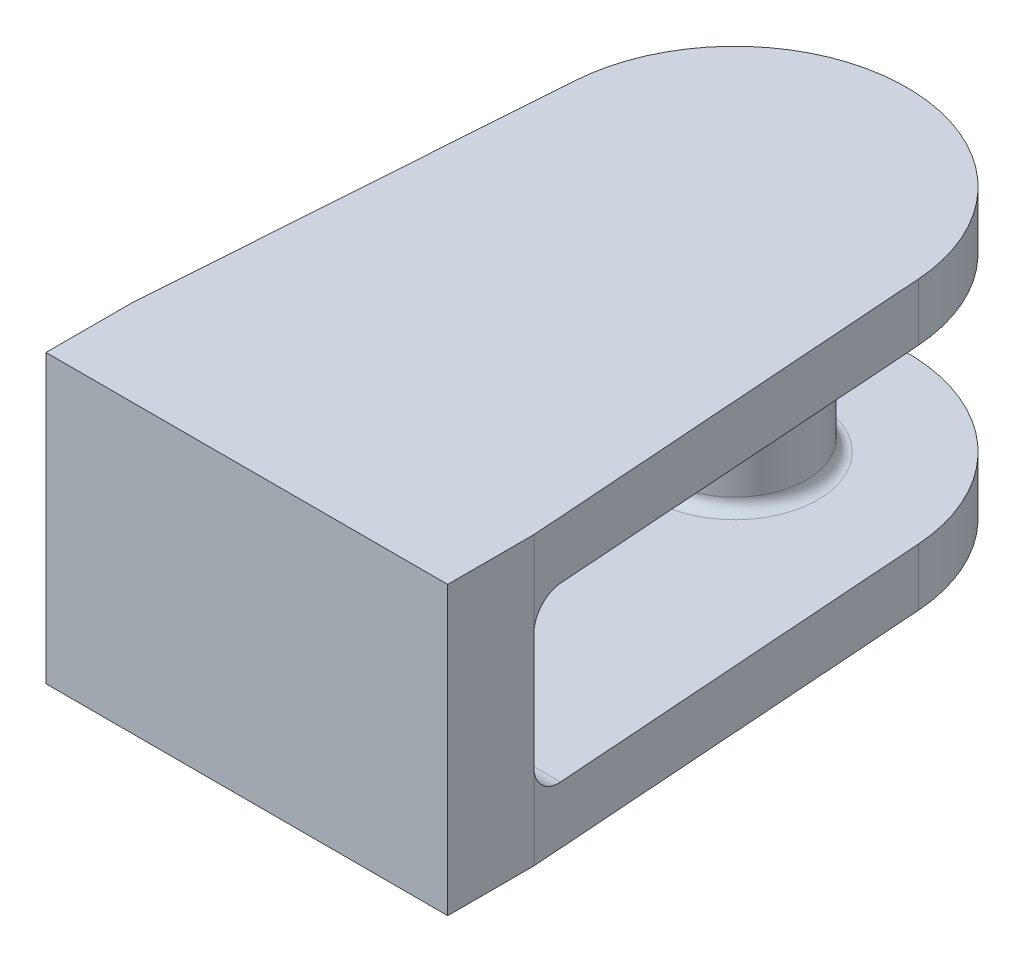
ISO-10303-21;
HEADER;
FILE_DESCRIPTION(('STEP AP214'),'2;1');
FILE_NAME('part.step','',(''),(''),'','','');
FILE_SCHEMA(('AUTOMOTIVE_DESIGN { 1 0 10303 214 1 1 1 1 }'));
ENDSEC;
DATA;
#1=APPLICATION_CONTEXT('core data for automotive mechanical design processes');
#2=APPLICATION_PROTOCOL_DEFINITION('international standard','automotive_design',2000,#1);
#3=PRODUCT_CONTEXT('',#1,'mechanical');
#4=PRODUCT('Part','Part','',(#3));
#5=PRODUCT_RELATED_PRODUCT_CATEGORY('part','',(#4));
#6=PRODUCT_DEFINITION_FORMATION('','',#4);
#7=PRODUCT_DEFINITION_CONTEXT('part definition',#1,'design');
#8=PRODUCT_DEFINITION('design','',#6,#7);
#9=PRODUCT_DEFINITION_SHAPE('','',#8);
#10=(LENGTH_UNIT() NAMED_UNIT(*) SI_UNIT(.MILLI.,.METRE.));
#11=(NAMED_UNIT(*) PLANE_ANGLE_UNIT() SI_UNIT($,.RADIAN.));
#12=(NAMED_UNIT(*) SI_UNIT($,.STERADIAN.) SOLID_ANGLE_UNIT());
#13=UNCERTAINTY_MEASURE_WITH_UNIT(LENGTH_MEASURE(1.E-05),#10,'distance_accuracy_value','');
#14=(GEOMETRIC_REPRESENTATION_CONTEXT(3) GLOBAL_UNCERTAINTY_ASSIGNED_CONTEXT((#13)) GLOBAL_UNIT_ASSIGNED_CONTEXT((#10,
#11,#12)) REPRESENTATION_CONTEXT('',''));
#15=CARTESIAN_POINT('',(0.,0.,0.));
#16=DIRECTION('',(0.,0.,1.));
#17=DIRECTION('',(1.,0.,0.));
#18=AXIS2_PLACEMENT_3D('',#15,#16,#17);
#19=CARTESIAN_POINT('',(0.,38.1,0.));
#20=DIRECTION('',(0.,-1.,0.));
#21=DIRECTION('',(0.,0.,-1.));
#22=AXIS2_PLACEMENT_3D('',#19,#20,#21);
#23=CYLINDRICAL_SURFACE('',#22,15.875);
#24=CARTESIAN_POINT('',(0.,2.54,0.));
#25=DIRECTION('',(0.,-1.,0.));
#26=DIRECTION('',(0.,0.,-1.));
#27=AXIS2_PLACEMENT_3D('',#24,#25,#26);
#28=CIRCLE('',#27,15.875);
#29=CARTESIAN_POINT('',(0.,2.54,-15.875));
#30=VERTEX_POINT('',#29);
#31=EDGE_CURVE('E41',#30,#30,#28,.F.);
#32=CARTESIAN_POINT('',(0.,35.56,0.));
#33=DIRECTION('',(0.,-1.,0.));
#34=DIRECTION('',(0.,0.,-1.));
#35=AXIS2_PLACEMENT_3D('',#32,#33,#34);
#36=CIRCLE('',#35,15.875);
#37=CARTESIAN_POINT('',(0.,35.56,-15.875));
#38=VERTEX_POINT('',#37);
#39=EDGE_CURVE('E144',#38,#38,#36,.T.);
#40=CARTESIAN_POINT('',(0.,2.54,-15.875));
#41=CARTESIAN_POINT('',(0.,2.88395833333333,-15.875));
#42=CARTESIAN_POINT('',(0.,3.22791666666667,-15.875));
#43=CARTESIAN_POINT('',(0.,3.91583333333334,-15.875));
#44=CARTESIAN_POINT('',(0.,4.25979166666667,-15.875));
#45=CARTESIAN_POINT('',(0.,4.94770833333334,-15.875));
#46=CARTESIAN_POINT('',(0.,5.29166666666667,-15.875));
#47=CARTESIAN_POINT('',(0.,5.97958333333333,-15.875));
#48=CARTESIAN_POINT('',(0.,6.32354166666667,-15.875));
#49=CARTESIAN_POINT('',(0.,7.01145833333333,-15.875));
#50=CARTESIAN_POINT('',(0.,7.35541666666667,-15.875));
#51=CARTESIAN_POINT('',(0.,8.04333333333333,-15.875));
#52=CARTESIAN_POINT('',(0.,8.38729166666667,-15.875));
#53=CARTESIAN_POINT('',(0.,9.07520833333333,-15.875));
#54=CARTESIAN_POINT('',(0.,9.41916666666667,-15.875));
#55=CARTESIAN_POINT('',(0.,10.1070833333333,-15.875));
#56=CARTESIAN_POINT('',(0.,10.4510416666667,-15.875));
#57=CARTESIAN_POINT('',(0.,11.1389583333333,-15.875));
#58=CARTESIAN_POINT('',(0.,11.4829166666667,-15.875));
#59=CARTESIAN_POINT('',(0.,12.1708333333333,-15.875));
#60=CARTESIAN_POINT('',(0.,12.5147916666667,-15.875));
#61=CARTESIAN_POINT('',(0.,13.2027083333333,-15.875));
#62=CARTESIAN_POINT('',(0.,13.5466666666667,-15.875));
#63=CARTESIAN_POINT('',(0.,14.2345833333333,-15.875));
#64=CARTESIAN_POINT('',(0.,14.5785416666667,-15.875));
#65=CARTESIAN_POINT('',(0.,15.2664583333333,-15.875));
#66=CARTESIAN_POINT('',(0.,15.6104166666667,-15.875));
#67=CARTESIAN_POINT('',(0.,16.2983333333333,-15.875));
#68=CARTESIAN_POINT('',(0.,16.6422916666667,-15.875));
#69=CARTESIAN_POINT('',(0.,17.3302083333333,-15.875));
#70=CARTESIAN_POINT('',(0.,17.6741666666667,-15.875));
#71=CARTESIAN_POINT('',(0.,18.3620833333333,-15.875));
#72=CARTESIAN_POINT('',(0.,18.7060416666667,-15.875));
#73=CARTESIAN_POINT('',(0.,19.3939583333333,-15.875));
#74=CARTESIAN_POINT('',(0.,19.7379166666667,-15.875));
#75=CARTESIAN_POINT('',(0.,20.4258333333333,-15.875));
#76=CARTESIAN_POINT('',(0.,20.7697916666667,-15.875));
#77=CARTESIAN_POINT('',(0.,21.4577083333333,-15.875));
#78=CARTESIAN_POINT('',(0.,21.8016666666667,-15.875));
#79=CARTESIAN_POINT('',(0.,22.4895833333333,-15.875));
#80=CARTESIAN_POINT('',(0.,22.8335416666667,-15.875));
#81=CARTESIAN_POINT('',(0.,23.5214583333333,-15.875));
#82=CARTESIAN_POINT('',(0.,23.8654166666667,-15.875));
#83=CARTESIAN_POINT('',(0.,24.5533333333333,-15.875));
#84=CARTESIAN_POINT('',(0.,24.8972916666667,-15.875));
#85=CARTESIAN_POINT('',(0.,25.5852083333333,-15.875));
#86=CARTESIAN_POINT('',(0.,25.9291666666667,-15.875));
#87=CARTESIAN_POINT('',(0.,26.6170833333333,-15.875));
#88=CARTESIAN_POINT('',(0.,26.9610416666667,-15.875));
#89=CARTESIAN_POINT('',(0.,27.6489583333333,-15.875));
#90=CARTESIAN_POINT('',(0.,27.9929166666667,-15.875));
#91=CARTESIAN_POINT('',(0.,28.6808333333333,-15.875));
#92=CARTESIAN_POINT('',(0.,29.0247916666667,-15.875));
#93=CARTESIAN_POINT('',(0.,29.7127083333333,-15.875));
#94=CARTESIAN_POINT('',(0.,30.0566666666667,-15.875));
#95=CARTESIAN_POINT('',(0.,30.7445833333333,-15.875));
#96=CARTESIAN_POINT('',(0.,31.0885416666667,-15.875));
#97=CARTESIAN_POINT('',(0.,31.7764583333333,-15.875));
#98=CARTESIAN_POINT('',(0.,32.1204166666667,-15.875));
#99=CARTESIAN_POINT('',(0.,32.8083333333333,-15.875));
#100=CARTESIAN_POINT('',(0.,33.1522916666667,-15.875));
#101=CARTESIAN_POINT('',(0.,33.8402083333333,-15.875));
#102=CARTESIAN_POINT('',(0.,34.1841666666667,-15.875));
#103=CARTESIAN_POINT('',(0.,34.8720833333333,-15.875));
#104=CARTESIAN_POINT('',(0.,35.2160416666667,-15.875));
#105=CARTESIAN_POINT('',(0.,35.56,-15.875));
#106=B_SPLINE_CURVE_WITH_KNOTS('',3,(#40,#41,#42,#43,#44,#45,#46,#47,#48,#49,#50,#51,#52,#53,
#54,#55,#56,#57,#58,#59,#60,#61,#62,#63,#64,#65,#66,#67,#68,#69,#70,#71,#72,#73,#74,#75,#76,#77,
#78,#79,#80,#81,#82,#83,#84,#85,#86,#87,#88,#89,#90,#91,#92,#93,#94,#95,#96,#97,#98,#99,#100,
#101,#102,#103,#104,#105),.UNSPECIFIED.,.F.,.F.,(4,2,2,2,2,2,2,2,2,2,2,2,2,2,2,2,2,2,2,2,2,2,2,
2,2,2,2,2,2,2,2,2,4),(0.,1.031875,2.06375,3.095625,4.1275,5.159375,6.19125,7.223125,8.255,
9.286875,10.31875,11.350625,12.3825,13.414375,14.44625,15.478125,16.51,17.541875,18.57375,
19.605625,20.6375,21.669375,22.70125,23.733125,24.765,25.796875,26.82875,27.860625,28.8925,
29.924375,30.95625,31.988125,33.02),.UNSPECIFIED.);
#107=EDGE_CURVE('BSEAM33',#30,#38,#106,.T.);
#108=ORIENTED_EDGE('',*,*,#31,.T.);
#109=ORIENTED_EDGE('',*,*,#39,.T.);
#110=ORIENTED_EDGE('',*,*,#107,.T.);
#111=ORIENTED_EDGE('',*,*,#107,.F.);
#112=EDGE_LOOP('',(#108,#110,#109,#111));
#113=FACE_BOUND('',#112,.T.);
#114=ADVANCED_FACE('F33',(#113),#23,.T.);
#115=CARTESIAN_POINT('',(0.,38.1,0.));
#116=DIRECTION('',(0.,-1.,0.));
#117=DIRECTION('',(0.,0.,-1.));
#118=AXIS2_PLACEMENT_3D('',#115,#116,#117);
#119=PLANE('',#118);
#120=CARTESIAN_POINT('',(0.,38.1,0.));
#121=DIRECTION('',(0.,-1.,0.));
#122=DIRECTION('',(0.,0.,-1.));
#123=AXIS2_PLACEMENT_3D('',#120,#121,#122);
#124=CIRCLE('',#123,18.415);
#125=CARTESIAN_POINT('',(0.,38.1,-18.415));
#126=VERTEX_POINT('',#125);
#127=EDGE_CURVE('E11',#126,#126,#124,.F.);
#128=ORIENTED_EDGE('',*,*,#127,.T.);
#129=EDGE_LOOP('',(#128));
#130=FACE_BOUND('',#129,.T.);
#131=DIRECTION('',(-0.0701952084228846,0.,-0.997533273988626));
#132=VECTOR('',#131,1.);
#133=CARTESIAN_POINT('',(38.0060177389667,38.1,-2.6744374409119));
#134=LINE('',#133,#132);
#135=CARTESIAN_POINT('',(44.0031581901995,38.1,82.55));
#136=VERTEX_POINT('',#135);
#137=CARTESIAN_POINT('',(38.0060177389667,38.1,-2.6744374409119));
#138=VERTEX_POINT('',#137);
#139=EDGE_CURVE('E108',#136,#138,#134,.T.);
#140=ORIENTED_EDGE('',*,*,#139,.F.);
#141=DIRECTION('',(1.,0.,0.));
#142=VECTOR('',#141,1.);
#143=CARTESIAN_POINT('',(0.,38.1,82.55));
#144=LINE('',#143,#142);
#145=CARTESIAN_POINT('',(-44.0031581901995,38.1,82.55));
#146=VERTEX_POINT('',#145);
#147=EDGE_CURVE('E120',#136,#146,#144,.F.);
#148=ORIENTED_EDGE('',*,*,#147,.T.);
#149=DIRECTION('',(-0.0701952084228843,0.,0.997533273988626));
#150=VECTOR('',#149,1.);
#151=CARTESIAN_POINT('',(-44.45,38.1,88.9));
#152=LINE('',#151,#150);
#153=CARTESIAN_POINT('',(-38.0060177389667,38.1,-2.67443744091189));
#154=VERTEX_POINT('',#153);
#155=EDGE_CURVE('E125',#154,#146,#152,.T.);
#156=ORIENTED_EDGE('',*,*,#155,.F.);
#157=CARTESIAN_POINT('',(0.,38.1,0.));
#158=DIRECTION('',(0.,1.,0.));
#159=DIRECTION('',(0.,0.,-1.));
#160=AXIS2_PLACEMENT_3D('',#157,#158,#159);
#161=CIRCLE('',#160,38.1);
#162=EDGE_CURVE('E123',#138,#154,#161,.T.);
#163=ORIENTED_EDGE('',*,*,#162,.F.);
#164=EDGE_LOOP('',(#140,#148,#156,#163));
#165=FACE_BOUND('',#164,.T.);
#166=ADVANCED_FACE('F119',(#130,#165),#119,.T.);
#167=CARTESIAN_POINT('',(0.,50.8,0.));
#168=DIRECTION('',(0.,-1.,0.));
#169=DIRECTION('',(0.,0.,-1.));
#170=AXIS2_PLACEMENT_3D('',#167,#168,#169);
#171=CYLINDRICAL_SURFACE('',#170,38.1);
#172=ORIENTED_EDGE('',*,*,#162,.T.);
#173=DIRECTION('',(0.,-1.,0.));
#174=VECTOR('',#173,1.);
#175=CARTESIAN_POINT('',(-38.0060177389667,50.8,-2.67443744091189));
#176=LINE('',#175,#174);
#177=CARTESIAN_POINT('',(-38.0060177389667,50.8,-2.67443744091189));
#178=VERTEX_POINT('',#177);
#179=EDGE_CURVE('E211',#178,#154,#176,.T.);
#180=ORIENTED_EDGE('',*,*,#179,.F.);
#181=CARTESIAN_POINT('',(0.,50.8,0.));
#182=DIRECTION('',(0.,1.,0.));
#183=DIRECTION('',(0.,0.,-1.));
#184=AXIS2_PLACEMENT_3D('',#181,#182,#183);
#185=CIRCLE('',#184,38.1);
#186=CARTESIAN_POINT('',(38.0060177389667,50.8,-2.6744374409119));
#187=VERTEX_POINT('',#186);
#188=EDGE_CURVE('E124',#187,#178,#185,.T.);
#189=ORIENTED_EDGE('',*,*,#188,.F.);
#190=DIRECTION('',(0.,-1.,0.));
#191=VECTOR('',#190,1.);
#192=CARTESIAN_POINT('',(38.0060177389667,50.8,-2.6744374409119));
#193=LINE('',#192,#191);
#194=EDGE_CURVE('E204',#187,#138,#193,.T.);
#195=ORIENTED_EDGE('',*,*,#194,.T.);
#196=EDGE_LOOP('',(#172,#180,#189,#195));
#197=FACE_BOUND('',#196,.T.);
#198=ADVANCED_FACE('F303',(#197),#171,.T.);
#199=CARTESIAN_POINT('',(-44.45,50.8,88.9));
#200=DIRECTION('',(0.997533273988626,0.,0.0701952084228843));
#201=DIRECTION('',(0.0701952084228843,0.,-0.997533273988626));
#202=AXIS2_PLACEMENT_3D('',#199,#200,#201);
#203=PLANE('',#202);
#204=ORIENTED_EDGE('',*,*,#155,.T.);
#205=CARTESIAN_POINT('',(-44.0031581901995,31.75,82.55));
#206=DIRECTION('',(0.997533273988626,0.,0.0701952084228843));
#207=DIRECTION('',(0.0701952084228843,0.,-0.997533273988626));
#208=AXIS2_PLACEMENT_3D('',#205,#206,#207);
#209=ELLIPSE('',#208,6.36570244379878,6.35);
#210=CARTESIAN_POINT('',(-44.45,31.75,88.9));
#211=VERTEX_POINT('',#210);
#212=EDGE_CURVE('E114',#146,#211,#209,.T.);
#213=ORIENTED_EDGE('',*,*,#212,.T.);
#214=DIRECTION('',(0.,-1.,0.));
#215=VECTOR('',#214,1.);
#216=CARTESIAN_POINT('',(-44.45,50.8,88.9));
#217=LINE('',#216,#215);
#218=CARTESIAN_POINT('',(-44.45,50.8,88.9));
#219=VERTEX_POINT('',#218);
#220=EDGE_CURVE('E48',#219,#211,#217,.T.);
#221=ORIENTED_EDGE('',*,*,#220,.F.);
#222=DIRECTION('',(-0.0701952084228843,0.,0.997533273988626));
#223=VECTOR('',#222,1.);
#224=CARTESIAN_POINT('',(-44.45,50.8,88.9));
#225=LINE('',#224,#223);
#226=EDGE_CURVE('E246',#178,#219,#225,.T.);
#227=ORIENTED_EDGE('',*,*,#226,.F.);
#228=ORIENTED_EDGE('',*,*,#179,.T.);
#229=EDGE_LOOP('',(#204,#213,#221,#227,#228));
#230=FACE_BOUND('',#229,.T.);
#231=ADVANCED_FACE('F299',(#230),#203,.F.);
#232=CARTESIAN_POINT('',(38.0060177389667,50.8,-2.6744374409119));
#233=DIRECTION('',(-0.997533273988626,0.,0.0701952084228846));
#234=DIRECTION('',(0.0701952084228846,0.,0.997533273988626));
#235=AXIS2_PLACEMENT_3D('',#232,#233,#234);
#236=PLANE('',#235);
#237=DIRECTION('',(0.,-1.,0.));
#238=VECTOR('',#237,1.);
#239=CARTESIAN_POINT('',(44.45,50.8,88.9));
#240=LINE('',#239,#238);
#241=CARTESIAN_POINT('',(44.45,50.8,88.9));
#242=VERTEX_POINT('',#241);
#243=CARTESIAN_POINT('',(44.45,31.75,88.9));
#244=VERTEX_POINT('',#243);
#245=EDGE_CURVE('E71',#242,#244,#240,.T.);
#246=ORIENTED_EDGE('',*,*,#245,.T.);
#247=CARTESIAN_POINT('',(44.0031581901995,31.75,82.55));
#248=DIRECTION('',(-0.997533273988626,0.,0.0701952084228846));
#249=DIRECTION('',(0.0701952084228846,0.,0.997533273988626));
#250=AXIS2_PLACEMENT_3D('',#247,#248,#249);
#251=ELLIPSE('',#250,6.36570244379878,6.35);
#252=EDGE_CURVE('E105',#244,#136,#251,.T.);
#253=ORIENTED_EDGE('',*,*,#252,.T.);
#254=ORIENTED_EDGE('',*,*,#139,.T.);
#255=ORIENTED_EDGE('',*,*,#194,.F.);
#256=DIRECTION('',(-0.0701952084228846,0.,-0.997533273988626));
#257=VECTOR('',#256,1.);
#258=CARTESIAN_POINT('',(38.0060177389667,50.8,-2.6744374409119));
#259=LINE('',#258,#257);
#260=EDGE_CURVE('E89',#242,#187,#259,.T.);
#261=ORIENTED_EDGE('',*,*,#260,.F.);
#262=EDGE_LOOP('',(#246,#253,#254,#255,#261));
#263=FACE_BOUND('',#262,.T.);
#264=ADVANCED_FACE('F107',(#263),#236,.F.);
#265=CARTESIAN_POINT('',(0.,50.8,0.));
#266=DIRECTION('',(0.,-1.,0.));
#267=DIRECTION('',(0.,0.,-1.));
#268=AXIS2_PLACEMENT_3D('',#265,#266,#267);
#269=PLANE('',#268);
#270=ORIENTED_EDGE('',*,*,#188,.T.);
#271=ORIENTED_EDGE('',*,*,#226,.T.);
#272=DIRECTION('',(0.,0.,-1.));
#273=VECTOR('',#272,1.);
#274=CARTESIAN_POINT('',(-44.45,50.8,107.95));
#275=LINE('',#274,#273);
#276=CARTESIAN_POINT('',(-44.45,50.8,107.95));
#277=VERTEX_POINT('',#276);
#278=EDGE_CURVE('E226',#277,#219,#275,.T.);
#279=ORIENTED_EDGE('',*,*,#278,.F.);
#280=DIRECTION('',(-1.,0.,0.));
#281=VECTOR('',#280,1.);
#282=CARTESIAN_POINT('',(-44.45,50.8,107.95));
#283=LINE('',#282,#281);
#284=CARTESIAN_POINT('',(44.45,50.8,107.95));
#285=VERTEX_POINT('',#284);
#286=EDGE_CURVE('E222',#285,#277,#283,.T.);
#287=ORIENTED_EDGE('',*,*,#286,.F.);
#288=DIRECTION('',(0.,0.,-1.));
#289=VECTOR('',#288,1.);
#290=CARTESIAN_POINT('',(44.45,50.8,107.95));
#291=LINE('',#290,#289);
#292=EDGE_CURVE('E228',#285,#242,#291,.T.);
#293=ORIENTED_EDGE('',*,*,#292,.T.);
#294=ORIENTED_EDGE('',*,*,#260,.T.);
#295=EDGE_LOOP('',(#270,#271,#279,#287,#293,#294));
#296=FACE_BOUND('',#295,.T.);
#297=ADVANCED_FACE('F160',(#296),#269,.F.);
#298=CARTESIAN_POINT('',(0.,0.,0.));
#299=DIRECTION('',(0.,-1.,0.));
#300=DIRECTION('',(0.,0.,-1.));
#301=AXIS2_PLACEMENT_3D('',#298,#299,#300);
#302=PLANE('',#301);
#303=CARTESIAN_POINT('',(0.,0.,0.));
#304=DIRECTION('',(0.,-1.,0.));
#305=DIRECTION('',(0.,0.,-1.));
#306=AXIS2_PLACEMENT_3D('',#303,#304,#305);
#307=CIRCLE('',#306,18.415);
#308=CARTESIAN_POINT('',(0.,0.,-18.415));
#309=VERTEX_POINT('',#308);
#310=EDGE_CURVE('E141',#309,#309,#307,.T.);
#311=ORIENTED_EDGE('',*,*,#310,.T.);
#312=EDGE_LOOP('',(#311));
#313=FACE_BOUND('',#312,.T.);
#314=DIRECTION('',(0.0701952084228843,0.,-0.997533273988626));
#315=VECTOR('',#314,1.);
#316=CARTESIAN_POINT('',(-44.45,0.,88.9));
#317=LINE('',#316,#315);
#318=CARTESIAN_POINT('',(-44.0031581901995,0.,82.55));
#319=VERTEX_POINT('',#318);
#320=CARTESIAN_POINT('',(-38.0060177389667,0.,-2.67443744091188));
#321=VERTEX_POINT('',#320);
#322=EDGE_CURVE('E165',#319,#321,#317,.T.);
#323=ORIENTED_EDGE('',*,*,#322,.F.);
#324=DIRECTION('',(-1.,0.,0.));
#325=VECTOR('',#324,1.);
#326=CARTESIAN_POINT('',(44.45,0.,82.55));
#327=LINE('',#326,#325);
#328=CARTESIAN_POINT('',(44.0031581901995,0.,82.55));
#329=VERTEX_POINT('',#328);
#330=EDGE_CURVE('E131',#319,#329,#327,.F.);
#331=ORIENTED_EDGE('',*,*,#330,.T.);
#332=DIRECTION('',(0.0701952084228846,0.,0.997533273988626));
#333=VECTOR('',#332,1.);
#334=CARTESIAN_POINT('',(38.0060177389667,0.,-2.67443744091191));
#335=LINE('',#334,#333);
#336=CARTESIAN_POINT('',(38.0060177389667,0.,-2.67443744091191));
#337=VERTEX_POINT('',#336);
#338=EDGE_CURVE('E175',#337,#329,#335,.T.);
#339=ORIENTED_EDGE('',*,*,#338,.F.);
#340=CARTESIAN_POINT('',(0.,0.,0.));
#341=DIRECTION('',(0.,-1.,0.));
#342=DIRECTION('',(0.,0.,-1.));
#343=AXIS2_PLACEMENT_3D('',#340,#341,#342);
#344=CIRCLE('',#343,38.1);
#345=EDGE_CURVE('E171',#321,#337,#344,.T.);
#346=ORIENTED_EDGE('',*,*,#345,.F.);
#347=EDGE_LOOP('',(#323,#331,#339,#346));
#348=FACE_BOUND('',#347,.T.);
#349=ADVANCED_FACE('F156',(#313,#348),#302,.F.);
#350=CARTESIAN_POINT('',(0.,-12.7,0.));
#351=DIRECTION('',(0.,1.,0.));
#352=DIRECTION('',(0.,0.,1.));
#353=AXIS2_PLACEMENT_3D('',#350,#351,#352);
#354=CYLINDRICAL_SURFACE('',#353,38.1);
#355=ORIENTED_EDGE('',*,*,#345,.T.);
#356=DIRECTION('',(0.,1.,0.));
#357=VECTOR('',#356,1.);
#358=CARTESIAN_POINT('',(38.0060177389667,-12.7,-2.67443744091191));
#359=LINE('',#358,#357);
#360=CARTESIAN_POINT('',(38.0060177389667,-12.7,-2.67443744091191));
#361=VERTEX_POINT('',#360);
#362=EDGE_CURVE('E189',#361,#337,#359,.T.);
#363=ORIENTED_EDGE('',*,*,#362,.F.);
#364=CARTESIAN_POINT('',(0.,-12.7,0.));
#365=DIRECTION('',(0.,-1.,0.));
#366=DIRECTION('',(0.,0.,-1.));
#367=AXIS2_PLACEMENT_3D('',#364,#365,#366);
#368=CIRCLE('',#367,38.1);
#369=CARTESIAN_POINT('',(-38.0060177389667,-12.7,-2.67443744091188));
#370=VERTEX_POINT('',#369);
#371=EDGE_CURVE('E174',#370,#361,#368,.T.);
#372=ORIENTED_EDGE('',*,*,#371,.F.);
#373=DIRECTION('',(0.,1.,0.));
#374=VECTOR('',#373,1.);
#375=CARTESIAN_POINT('',(-38.0060177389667,-12.7,-2.67443744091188));
#376=LINE('',#375,#374);
#377=EDGE_CURVE('E241',#370,#321,#376,.T.);
#378=ORIENTED_EDGE('',*,*,#377,.T.);
#379=EDGE_LOOP('',(#355,#363,#372,#378));
#380=FACE_BOUND('',#379,.T.);
#381=ADVANCED_FACE('F159',(#380),#354,.T.);
#382=CARTESIAN_POINT('',(38.0060177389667,-12.7,-2.67443744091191));
#383=DIRECTION('',(-0.997533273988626,0.,0.0701952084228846));
#384=DIRECTION('',(0.0701952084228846,0.,0.997533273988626));
#385=AXIS2_PLACEMENT_3D('',#382,#383,#384);
#386=PLANE('',#385);
#387=ORIENTED_EDGE('',*,*,#338,.T.);
#388=CARTESIAN_POINT('',(44.0031581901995,6.35,82.55));
#389=DIRECTION('',(-0.997533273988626,0.,0.0701952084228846));
#390=DIRECTION('',(0.0701952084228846,0.,0.997533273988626));
#391=AXIS2_PLACEMENT_3D('',#388,#389,#390);
#392=ELLIPSE('',#391,6.36570244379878,6.35);
#393=CARTESIAN_POINT('',(44.45,6.34999999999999,88.9));
#394=VERTEX_POINT('',#393);
#395=EDGE_CURVE('E115',#329,#394,#392,.T.);
#396=ORIENTED_EDGE('',*,*,#395,.T.);
#397=DIRECTION('',(0.,1.,0.));
#398=VECTOR('',#397,1.);
#399=CARTESIAN_POINT('',(44.45,-12.7,88.9));
#400=LINE('',#399,#398);
#401=CARTESIAN_POINT('',(44.45,-12.7,88.9));
#402=VERTEX_POINT('',#401);
#403=EDGE_CURVE('E57',#402,#394,#400,.T.);
#404=ORIENTED_EDGE('',*,*,#403,.F.);
#405=DIRECTION('',(0.0701952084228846,0.,0.997533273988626));
#406=VECTOR('',#405,1.);
#407=CARTESIAN_POINT('',(38.0060177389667,-12.7,-2.67443744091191));
#408=LINE('',#407,#406);
#409=EDGE_CURVE('E236',#361,#402,#408,.T.);
#410=ORIENTED_EDGE('',*,*,#409,.F.);
#411=ORIENTED_EDGE('',*,*,#362,.T.);
#412=EDGE_LOOP('',(#387,#396,#404,#410,#411));
#413=FACE_BOUND('',#412,.T.);
#414=ADVANCED_FACE('F183',(#413),#386,.F.);
#415=CARTESIAN_POINT('',(-44.45,-12.7,88.9));
#416=DIRECTION('',(0.997533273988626,0.,0.0701952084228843));
#417=DIRECTION('',(0.0701952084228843,0.,-0.997533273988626));
#418=AXIS2_PLACEMENT_3D('',#415,#416,#417);
#419=PLANE('',#418);
#420=DIRECTION('',(0.,1.,0.));
#421=VECTOR('',#420,1.);
#422=CARTESIAN_POINT('',(-44.45,-12.7,88.9));
#423=LINE('',#422,#421);
#424=CARTESIAN_POINT('',(-44.45,-12.7,88.9));
#425=VERTEX_POINT('',#424);
#426=CARTESIAN_POINT('',(-44.45,6.35,88.9));
#427=VERTEX_POINT('',#426);
#428=EDGE_CURVE('E81',#425,#427,#423,.T.);
#429=ORIENTED_EDGE('',*,*,#428,.T.);
#430=CARTESIAN_POINT('',(-44.0031581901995,6.35,82.55));
#431=DIRECTION('',(0.997533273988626,0.,0.0701952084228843));
#432=DIRECTION('',(0.0701952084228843,0.,-0.997533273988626));
#433=AXIS2_PLACEMENT_3D('',#430,#431,#432);
#434=ELLIPSE('',#433,6.36570244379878,6.35);
#435=EDGE_CURVE('E130',#427,#319,#434,.T.);
#436=ORIENTED_EDGE('',*,*,#435,.T.);
#437=ORIENTED_EDGE('',*,*,#322,.T.);
#438=ORIENTED_EDGE('',*,*,#377,.F.);
#439=DIRECTION('',(0.0701952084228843,0.,-0.997533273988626));
#440=VECTOR('',#439,1.);
#441=CARTESIAN_POINT('',(-44.45,-12.7,88.9));
#442=LINE('',#441,#440);
#443=EDGE_CURVE('E239',#425,#370,#442,.T.);
#444=ORIENTED_EDGE('',*,*,#443,.F.);
#445=EDGE_LOOP('',(#429,#436,#437,#438,#444));
#446=FACE_BOUND('',#445,.T.);
#447=ADVANCED_FACE('F385',(#446),#419,.F.);
#448=CARTESIAN_POINT('',(0.,-12.7,0.));
#449=DIRECTION('',(0.,-1.,0.));
#450=DIRECTION('',(0.,0.,-1.));
#451=AXIS2_PLACEMENT_3D('',#448,#449,#450);
#452=PLANE('',#451);
#453=ORIENTED_EDGE('',*,*,#371,.T.);
#454=ORIENTED_EDGE('',*,*,#409,.T.);
#455=DIRECTION('',(0.,0.,-1.));
#456=VECTOR('',#455,1.);
#457=CARTESIAN_POINT('',(44.45,-12.7,107.95));
#458=LINE('',#457,#456);
#459=CARTESIAN_POINT('',(44.45,-12.7,107.95));
#460=VERTEX_POINT('',#459);
#461=EDGE_CURVE('E230',#460,#402,#458,.T.);
#462=ORIENTED_EDGE('',*,*,#461,.F.);
#463=DIRECTION('',(1.,0.,0.));
#464=VECTOR('',#463,1.);
#465=CARTESIAN_POINT('',(-44.45,-12.7,107.95));
#466=LINE('',#465,#464);
#467=CARTESIAN_POINT('',(-44.45,-12.7,107.95));
#468=VERTEX_POINT('',#467);
#469=EDGE_CURVE('E263',#468,#460,#466,.T.);
#470=ORIENTED_EDGE('',*,*,#469,.F.);
#471=DIRECTION('',(0.,0.,-1.));
#472=VECTOR('',#471,1.);
#473=CARTESIAN_POINT('',(-44.45,-12.7,107.95));
#474=LINE('',#473,#472);
#475=EDGE_CURVE('E191',#468,#425,#474,.T.);
#476=ORIENTED_EDGE('',*,*,#475,.T.);
#477=ORIENTED_EDGE('',*,*,#443,.T.);
#478=EDGE_LOOP('',(#453,#454,#462,#470,#476,#477));
#479=FACE_BOUND('',#478,.T.);
#480=ADVANCED_FACE('F288',(#479),#452,.T.);
#481=CARTESIAN_POINT('',(-44.45,-12.7,88.9));
#482=DIRECTION('',(0.,0.,1.));
#483=DIRECTION('',(1.,0.,0.));
#484=AXIS2_PLACEMENT_3D('',#481,#482,#483);
#485=PLANE('',#484);
#486=DIRECTION('',(0.,1.,0.));
#487=VECTOR('',#486,1.);
#488=CARTESIAN_POINT('',(44.45,50.8,88.9));
#489=LINE('',#488,#487);
#490=EDGE_CURVE('E217',#394,#244,#489,.T.);
#491=ORIENTED_EDGE('',*,*,#490,.F.);
#492=DIRECTION('',(-1.,0.,0.));
#493=VECTOR('',#492,1.);
#494=CARTESIAN_POINT('',(-44.45,6.35,88.9));
#495=LINE('',#494,#493);
#496=EDGE_CURVE('E134',#394,#427,#495,.T.);
#497=ORIENTED_EDGE('',*,*,#496,.T.);
#498=DIRECTION('',(0.,-1.,0.));
#499=VECTOR('',#498,1.);
#500=CARTESIAN_POINT('',(-44.45,50.8,88.9));
#501=LINE('',#500,#499);
#502=EDGE_CURVE('E214',#211,#427,#501,.T.);
#503=ORIENTED_EDGE('',*,*,#502,.F.);
#504=DIRECTION('',(1.,0.,0.));
#505=VECTOR('',#504,1.);
#506=CARTESIAN_POINT('',(-44.45,31.75,88.9));
#507=LINE('',#506,#505);
#508=EDGE_CURVE('E254',#211,#244,#507,.T.);
#509=ORIENTED_EDGE('',*,*,#508,.T.);
#510=EDGE_LOOP('',(#491,#497,#503,#509));
#511=FACE_BOUND('',#510,.T.);
#512=ADVANCED_FACE('F258',(#511),#485,.F.);
#513=CARTESIAN_POINT('',(-44.45,50.8,107.95));
#514=DIRECTION('',(1.,0.,0.));
#515=DIRECTION('',(0.,1.,0.));
#516=AXIS2_PLACEMENT_3D('',#513,#514,#515);
#517=PLANE('',#516);
#518=ORIENTED_EDGE('',*,*,#220,.T.);
#519=ORIENTED_EDGE('',*,*,#502,.T.);
#520=ORIENTED_EDGE('',*,*,#428,.F.);
#521=ORIENTED_EDGE('',*,*,#475,.F.);
#522=DIRECTION('',(0.,-1.,0.));
#523=VECTOR('',#522,1.);
#524=CARTESIAN_POINT('',(-44.45,50.8,107.95));
#525=LINE('',#524,#523);
#526=EDGE_CURVE('E261',#277,#468,#525,.T.);
#527=ORIENTED_EDGE('',*,*,#526,.F.);
#528=ORIENTED_EDGE('',*,*,#278,.T.);
#529=EDGE_LOOP('',(#518,#519,#520,#521,#527,#528));
#530=FACE_BOUND('',#529,.T.);
#531=ADVANCED_FACE('F282',(#530),#517,.F.);
#532=CARTESIAN_POINT('',(44.45,50.8,107.95));
#533=DIRECTION('',(-1.,0.,0.));
#534=DIRECTION('',(0.,-1.,0.));
#535=AXIS2_PLACEMENT_3D('',#532,#533,#534);
#536=PLANE('',#535);
#537=ORIENTED_EDGE('',*,*,#403,.T.);
#538=ORIENTED_EDGE('',*,*,#490,.T.);
#539=ORIENTED_EDGE('',*,*,#245,.F.);
#540=ORIENTED_EDGE('',*,*,#292,.F.);
#541=DIRECTION('',(0.,1.,0.));
#542=VECTOR('',#541,1.);
#543=CARTESIAN_POINT('',(44.45,50.8,107.95));
#544=LINE('',#543,#542);
#545=EDGE_CURVE('E271',#460,#285,#544,.T.);
#546=ORIENTED_EDGE('',*,*,#545,.F.);
#547=ORIENTED_EDGE('',*,*,#461,.T.);
#548=EDGE_LOOP('',(#537,#538,#539,#540,#546,#547));
#549=FACE_BOUND('',#548,.T.);
#550=ADVANCED_FACE('F259',(#549),#536,.F.);
#551=CARTESIAN_POINT('',(-44.45,-12.7,107.95));
#552=DIRECTION('',(0.,0.,1.));
#553=DIRECTION('',(1.,0.,0.));
#554=AXIS2_PLACEMENT_3D('',#551,#552,#553);
#555=PLANE('',#554);
#556=ORIENTED_EDGE('',*,*,#526,.T.);
#557=ORIENTED_EDGE('',*,*,#469,.T.);
#558=ORIENTED_EDGE('',*,*,#545,.T.);
#559=ORIENTED_EDGE('',*,*,#286,.T.);
#560=EDGE_LOOP('',(#556,#557,#558,#559));
#561=FACE_BOUND('',#560,.T.);
#562=ADVANCED_FACE('F279',(#561),#555,.T.);
#563=CARTESIAN_POINT('',(-44.45,6.35,82.55));
#564=DIRECTION('',(1.,0.,0.));
#565=DIRECTION('',(0.,0.,-1.));
#566=AXIS2_PLACEMENT_3D('',#563,#564,#565);
#567=CYLINDRICAL_SURFACE('',#566,6.35);
#568=ORIENTED_EDGE('',*,*,#395,.F.);
#569=ORIENTED_EDGE('',*,*,#330,.F.);
#570=ORIENTED_EDGE('',*,*,#435,.F.);
#571=ORIENTED_EDGE('',*,*,#496,.F.);
#572=EDGE_LOOP('',(#568,#569,#570,#571));
#573=FACE_BOUND('',#572,.T.);
#574=ADVANCED_FACE('F179',(#573),#567,.F.);
#575=CARTESIAN_POINT('',(-44.45,31.75,82.55));
#576=DIRECTION('',(1.,0.,0.));
#577=DIRECTION('',(0.,0.,-1.));
#578=AXIS2_PLACEMENT_3D('',#575,#576,#577);
#579=CYLINDRICAL_SURFACE('',#578,6.35);
#580=ORIENTED_EDGE('',*,*,#212,.F.);
#581=ORIENTED_EDGE('',*,*,#147,.F.);
#582=ORIENTED_EDGE('',*,*,#252,.F.);
#583=ORIENTED_EDGE('',*,*,#508,.F.);
#584=EDGE_LOOP('',(#580,#581,#582,#583));
#585=FACE_BOUND('',#584,.T.);
#586=ADVANCED_FACE('F128',(#585),#579,.F.);
#587=CARTESIAN_POINT('',(0.,2.54,0.));
#588=DIRECTION('',(0.,-1.,0.));
#589=DIRECTION('',(0.,0.,-1.));
#590=AXIS2_PLACEMENT_3D('',#587,#588,#589);
#591=TOROIDAL_SURFACE('',#590,18.415,2.54);
#592=ORIENTED_EDGE('',*,*,#31,.F.);
#593=EDGE_LOOP('',(#592));
#594=FACE_BOUND('',#593,.T.);
#595=ORIENTED_EDGE('',*,*,#310,.F.);
#596=EDGE_LOOP('',(#595));
#597=FACE_BOUND('',#596,.T.);
#598=ADVANCED_FACE('F151',(#594,#597),#591,.F.);
#599=CARTESIAN_POINT('',(0.,35.56,0.));
#600=DIRECTION('',(0.,-1.,0.));
#601=DIRECTION('',(0.,0.,-1.));
#602=AXIS2_PLACEMENT_3D('',#599,#600,#601);
#603=TOROIDAL_SURFACE('',#602,18.415,2.54);
#604=ORIENTED_EDGE('',*,*,#39,.F.);
#605=EDGE_LOOP('',(#604));
#606=FACE_BOUND('',#605,.T.);
#607=ORIENTED_EDGE('',*,*,#127,.F.);
#608=EDGE_LOOP('',(#607));
#609=FACE_BOUND('',#608,.T.);
#610=ADVANCED_FACE('F35',(#606,#609),#603,.F.);
#611=CLOSED_SHELL('',(#114,#166,#198,#231,#264,#297,#349,#381,#414,#447,#480,#512,#531,#550,
#562,#574,#586,#598,#610));
#612=MANIFOLD_SOLID_BREP('B2',#611);
#613=ADVANCED_BREP_SHAPE_REPRESENTATION('',(#18,#612),#14);
#614=SHAPE_DEFINITION_REPRESENTATION(#9,#613);
ENDSEC;
END-ISO-10303-21;
